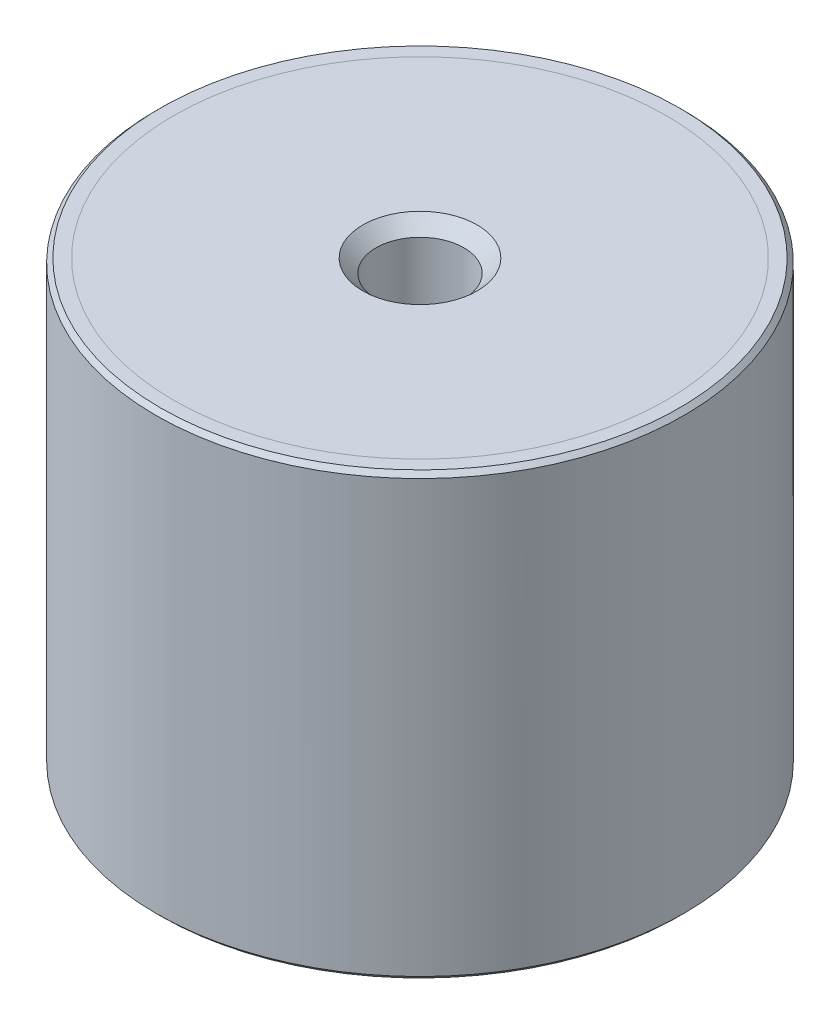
ISO-10303-21;
HEADER;
FILE_DESCRIPTION(('STEP AP214'),'2;1');
FILE_NAME('part.step','',(''),(''),'','','');
FILE_SCHEMA(('AUTOMOTIVE_DESIGN { 1 0 10303 214 1 1 1 1 }'));
ENDSEC;
DATA;
#1=APPLICATION_CONTEXT('core data for automotive mechanical design processes');
#2=APPLICATION_PROTOCOL_DEFINITION('international standard','automotive_design',2000,#1);
#3=PRODUCT_CONTEXT('',#1,'mechanical');
#4=PRODUCT('Part','Part','',(#3));
#5=PRODUCT_RELATED_PRODUCT_CATEGORY('part','',(#4));
#6=PRODUCT_DEFINITION_FORMATION('','',#4);
#7=PRODUCT_DEFINITION_CONTEXT('part definition',#1,'design');
#8=PRODUCT_DEFINITION('design','',#6,#7);
#9=PRODUCT_DEFINITION_SHAPE('','',#8);
#10=(LENGTH_UNIT() NAMED_UNIT(*) SI_UNIT(.MILLI.,.METRE.));
#11=(NAMED_UNIT(*) PLANE_ANGLE_UNIT() SI_UNIT($,.RADIAN.));
#12=(NAMED_UNIT(*) SI_UNIT($,.STERADIAN.) SOLID_ANGLE_UNIT());
#13=UNCERTAINTY_MEASURE_WITH_UNIT(LENGTH_MEASURE(1.E-05),#10,'distance_accuracy_value','');
#14=(GEOMETRIC_REPRESENTATION_CONTEXT(3) GLOBAL_UNCERTAINTY_ASSIGNED_CONTEXT((#13)) GLOBAL_UNIT_ASSIGNED_CONTEXT((#10,
#11,#12)) REPRESENTATION_CONTEXT('',''));
#15=CARTESIAN_POINT('',(0.,0.,0.));
#16=DIRECTION('',(0.,0.,1.));
#17=DIRECTION('',(1.,0.,0.));
#18=AXIS2_PLACEMENT_3D('',#15,#16,#17);
#19=CARTESIAN_POINT('',(0.,-47.,5.));
#20=DIRECTION('',(0.,1.,0.));
#21=DIRECTION('',(0.,0.,1.));
#22=AXIS2_PLACEMENT_3D('',#19,#20,#21);
#23=PLANE('',#22);
#24=CARTESIAN_POINT('',(0.,-47.,0.));
#25=DIRECTION('',(0.,1.,0.));
#26=DIRECTION('',(0.,0.,1.));
#27=AXIS2_PLACEMENT_3D('',#24,#25,#26);
#28=CIRCLE('',#27,28.);
#29=CARTESIAN_POINT('',(0.,-47.,28.));
#30=VERTEX_POINT('',#29);
#31=EDGE_CURVE('P0_E25',#30,#30,#28,.T.);
#32=ORIENTED_EDGE('',*,*,#31,.T.);
#33=EDGE_LOOP('',(#32));
#34=FACE_BOUND('',#33,.T.);
#35=CARTESIAN_POINT('',(0.,-47.,0.));
#36=DIRECTION('',(0.,1.,0.));
#37=DIRECTION('',(0.,0.,1.));
#38=AXIS2_PLACEMENT_3D('',#35,#36,#37);
#39=CIRCLE('',#38,5.);
#40=CARTESIAN_POINT('',(0.,-47.,5.));
#41=VERTEX_POINT('',#40);
#42=EDGE_CURVE('P0_E21',#41,#41,#39,.T.);
#43=ORIENTED_EDGE('',*,*,#42,.F.);
#44=EDGE_LOOP('',(#43));
#45=FACE_BOUND('',#44,.T.);
#46=ADVANCED_FACE('P0_F14',(#34,#45),#23,.T.);
#47=CARTESIAN_POINT('',(0.,21.0340428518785,0.));
#48=DIRECTION('',(0.,1.,0.));
#49=DIRECTION('',(0.,0.,1.));
#50=AXIS2_PLACEMENT_3D('',#47,#48,#49);
#51=CYLINDRICAL_SURFACE('',#50,28.);
#52=CARTESIAN_POINT('',(0.,-48.5,0.));
#53=DIRECTION('',(0.,1.,0.));
#54=DIRECTION('',(0.,0.,1.));
#55=AXIS2_PLACEMENT_3D('',#52,#53,#54);
#56=CIRCLE('',#55,28.);
#57=CARTESIAN_POINT('',(0.,-48.5,28.));
#58=VERTEX_POINT('',#57);
#59=EDGE_CURVE('P0_E29',#58,#58,#56,.T.);
#60=ORIENTED_EDGE('',*,*,#59,.T.);
#61=EDGE_LOOP('',(#60));
#62=FACE_BOUND('',#61,.T.);
#63=ORIENTED_EDGE('',*,*,#31,.F.);
#64=EDGE_LOOP('',(#63));
#65=FACE_BOUND('',#64,.T.);
#66=ADVANCED_FACE('P0_F35',(#62,#65),#51,.T.);
#67=CARTESIAN_POINT('',(0.,-48.5,28.));
#68=DIRECTION('',(0.,-1.,0.));
#69=DIRECTION('',(0.,0.,-1.));
#70=AXIS2_PLACEMENT_3D('',#67,#68,#69);
#71=PLANE('',#70);
#72=CARTESIAN_POINT('',(0.,-48.5,0.));
#73=DIRECTION('',(0.,-1.,0.));
#74=DIRECTION('',(0.,0.,-1.));
#75=AXIS2_PLACEMENT_3D('',#72,#73,#74);
#76=CIRCLE('',#75,6.49999999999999);
#77=CARTESIAN_POINT('',(0.,-48.5,-6.49999999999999));
#78=VERTEX_POINT('',#77);
#79=EDGE_CURVE('P0_E10',#78,#78,#76,.F.);
#80=ORIENTED_EDGE('',*,*,#79,.T.);
#81=EDGE_LOOP('',(#80));
#82=FACE_BOUND('',#81,.T.);
#83=ORIENTED_EDGE('',*,*,#59,.F.);
#84=EDGE_LOOP('',(#83));
#85=FACE_BOUND('',#84,.T.);
#86=ADVANCED_FACE('P0_F38',(#82,#85),#71,.T.);
#87=CARTESIAN_POINT('',(0.,-48.5,0.));
#88=DIRECTION('',(0.,-1.,0.));
#89=DIRECTION('',(0.,0.,-1.));
#90=AXIS2_PLACEMENT_3D('',#87,#88,#89);
#91=CONICAL_SURFACE('',#90,6.49999999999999,0.785398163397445);
#92=ORIENTED_EDGE('',*,*,#42,.T.);
#93=EDGE_LOOP('',(#92));
#94=FACE_BOUND('',#93,.T.);
#95=ORIENTED_EDGE('',*,*,#79,.F.);
#96=EDGE_LOOP('',(#95));
#97=FACE_BOUND('',#96,.T.);
#98=ADVANCED_FACE('P0_F16',(#94,#97),#91,.F.);
#99=CLOSED_SHELL('',(#46,#66,#86,#98));
#100=MANIFOLD_SOLID_BREP('P0_B1',#99);
#101=CARTESIAN_POINT('',(0.,1.5,5.));
#102=DIRECTION('',(0.,1.,0.));
#103=DIRECTION('',(0.,0.,1.));
#104=AXIS2_PLACEMENT_3D('',#101,#102,#103);
#105=PLANE('',#104);
#106=CARTESIAN_POINT('',(0.,1.5,0.));
#107=DIRECTION('',(0.,1.,0.));
#108=DIRECTION('',(0.,0.,1.));
#109=AXIS2_PLACEMENT_3D('',#106,#107,#108);
#110=CIRCLE('',#109,6.49999999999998);
#111=CARTESIAN_POINT('',(0.,1.5,6.49999999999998));
#112=VERTEX_POINT('',#111);
#113=EDGE_CURVE('P1_E10',#112,#112,#110,.F.);
#114=ORIENTED_EDGE('',*,*,#113,.T.);
#115=EDGE_LOOP('',(#114));
#116=FACE_BOUND('',#115,.T.);
#117=CARTESIAN_POINT('',(0.,1.5,0.));
#118=DIRECTION('',(0.,1.,0.));
#119=DIRECTION('',(0.,0.,1.));
#120=AXIS2_PLACEMENT_3D('',#117,#118,#119);
#121=CIRCLE('',#120,28.);
#122=CARTESIAN_POINT('',(0.,1.5,28.));
#123=VERTEX_POINT('',#122);
#124=EDGE_CURVE('P1_E21',#123,#123,#121,.T.);
#125=ORIENTED_EDGE('',*,*,#124,.T.);
#126=EDGE_LOOP('',(#125));
#127=FACE_BOUND('',#126,.T.);
#128=ADVANCED_FACE('P1_F14',(#116,#127),#105,.T.);
#129=CARTESIAN_POINT('',(0.,69.5340428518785,0.));
#130=DIRECTION('',(0.,1.,0.));
#131=DIRECTION('',(0.,0.,1.));
#132=AXIS2_PLACEMENT_3D('',#129,#130,#131);
#133=CYLINDRICAL_SURFACE('',#132,28.);
#134=CARTESIAN_POINT('',(0.,0.,0.));
#135=DIRECTION('',(0.,1.,0.));
#136=DIRECTION('',(0.,0.,1.));
#137=AXIS2_PLACEMENT_3D('',#134,#135,#136);
#138=CIRCLE('',#137,28.);
#139=CARTESIAN_POINT('',(0.,0.,28.));
#140=VERTEX_POINT('',#139);
#141=EDGE_CURVE('P1_E25',#140,#140,#138,.T.);
#142=ORIENTED_EDGE('',*,*,#141,.T.);
#143=EDGE_LOOP('',(#142));
#144=FACE_BOUND('',#143,.T.);
#145=ORIENTED_EDGE('',*,*,#124,.F.);
#146=EDGE_LOOP('',(#145));
#147=FACE_BOUND('',#146,.T.);
#148=ADVANCED_FACE('P1_F44',(#144,#147),#133,.T.);
#149=CARTESIAN_POINT('',(0.,0.,28.));
#150=DIRECTION('',(0.,-1.,0.));
#151=DIRECTION('',(0.,0.,-1.));
#152=AXIS2_PLACEMENT_3D('',#149,#150,#151);
#153=PLANE('',#152);
#154=CARTESIAN_POINT('',(0.,0.,0.));
#155=DIRECTION('',(0.,1.,0.));
#156=DIRECTION('',(0.,0.,1.));
#157=AXIS2_PLACEMENT_3D('',#154,#155,#156);
#158=CIRCLE('',#157,5.);
#159=CARTESIAN_POINT('',(0.,0.,4.99999999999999));
#160=VERTEX_POINT('',#159);
#161=EDGE_CURVE('P1_E29',#160,#160,#158,.T.);
#162=ORIENTED_EDGE('',*,*,#161,.T.);
#163=EDGE_LOOP('',(#162));
#164=FACE_BOUND('',#163,.T.);
#165=ORIENTED_EDGE('',*,*,#141,.F.);
#166=EDGE_LOOP('',(#165));
#167=FACE_BOUND('',#166,.T.);
#168=ADVANCED_FACE('P1_F35',(#164,#167),#153,.T.);
#169=CARTESIAN_POINT('',(0.,0.,0.));
#170=DIRECTION('',(0.,1.,0.));
#171=DIRECTION('',(0.,0.,1.));
#172=AXIS2_PLACEMENT_3D('',#169,#170,#171);
#173=CONICAL_SURFACE('',#172,5.,0.785398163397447);
#174=CARTESIAN_POINT('',(0.,1.5,6.49999999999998));
#175=CARTESIAN_POINT('',(0.,1.484375,6.48437499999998));
#176=CARTESIAN_POINT('',(0.,1.46875,6.46874999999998));
#177=CARTESIAN_POINT('',(0.,1.4375,6.43749999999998));
#178=CARTESIAN_POINT('',(0.,1.421875,6.42187499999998));
#179=CARTESIAN_POINT('',(0.,1.390625,6.39062499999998));
#180=CARTESIAN_POINT('',(0.,1.375,6.37499999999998));
#181=CARTESIAN_POINT('',(0.,1.34375,6.34374999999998));
#182=CARTESIAN_POINT('',(0.,1.328125,6.32812499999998));
#183=CARTESIAN_POINT('',(0.,1.296875,6.29687499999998));
#184=CARTESIAN_POINT('',(0.,1.28125,6.28124999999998));
#185=CARTESIAN_POINT('',(0.,1.25,6.24999999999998));
#186=CARTESIAN_POINT('',(0.,1.234375,6.23437499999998));
#187=CARTESIAN_POINT('',(0.,1.203125,6.20312499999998));
#188=CARTESIAN_POINT('',(0.,1.1875,6.18749999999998));
#189=CARTESIAN_POINT('',(0.,1.15625,6.15624999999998));
#190=CARTESIAN_POINT('',(0.,1.140625,6.14062499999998));
#191=CARTESIAN_POINT('',(0.,1.109375,6.10937499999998));
#192=CARTESIAN_POINT('',(0.,1.09375,6.09374999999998));
#193=CARTESIAN_POINT('',(0.,1.0625,6.06249999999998));
#194=CARTESIAN_POINT('',(0.,1.046875,6.04687499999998));
#195=CARTESIAN_POINT('',(0.,1.015625,6.01562499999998));
#196=CARTESIAN_POINT('',(0.,0.999999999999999,5.99999999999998));
#197=CARTESIAN_POINT('',(0.,0.968749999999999,5.96874999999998));
#198=CARTESIAN_POINT('',(0.,0.953124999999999,5.95312499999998));
#199=CARTESIAN_POINT('',(0.,0.921874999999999,5.92187499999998));
#200=CARTESIAN_POINT('',(0.,0.906249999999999,5.90624999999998));
#201=CARTESIAN_POINT('',(0.,0.874999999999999,5.87499999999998));
#202=CARTESIAN_POINT('',(0.,0.859374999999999,5.85937499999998));
#203=CARTESIAN_POINT('',(0.,0.828124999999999,5.82812499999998));
#204=CARTESIAN_POINT('',(0.,0.812499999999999,5.81249999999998));
#205=CARTESIAN_POINT('',(0.,0.781249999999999,5.78124999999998));
#206=CARTESIAN_POINT('',(0.,0.765624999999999,5.76562499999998));
#207=CARTESIAN_POINT('',(0.,0.734374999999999,5.73437499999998));
#208=CARTESIAN_POINT('',(0.,0.718749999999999,5.71874999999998));
#209=CARTESIAN_POINT('',(0.,0.687499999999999,5.68749999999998));
#210=CARTESIAN_POINT('',(0.,0.671874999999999,5.67187499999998));
#211=CARTESIAN_POINT('',(0.,0.640624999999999,5.64062499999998));
#212=CARTESIAN_POINT('',(0.,0.624999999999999,5.62499999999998));
#213=CARTESIAN_POINT('',(0.,0.593749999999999,5.59374999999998));
#214=CARTESIAN_POINT('',(0.,0.578124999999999,5.57812499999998));
#215=CARTESIAN_POINT('',(0.,0.546874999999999,5.54687499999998));
#216=CARTESIAN_POINT('',(0.,0.531249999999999,5.53124999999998));
#217=CARTESIAN_POINT('',(0.,0.499999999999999,5.49999999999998));
#218=CARTESIAN_POINT('',(0.,0.484374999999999,5.48437499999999));
#219=CARTESIAN_POINT('',(0.,0.453124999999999,5.45312499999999));
#220=CARTESIAN_POINT('',(0.,0.437499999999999,5.43749999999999));
#221=CARTESIAN_POINT('',(0.,0.406249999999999,5.40624999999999));
#222=CARTESIAN_POINT('',(0.,0.390624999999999,5.39062499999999));
#223=CARTESIAN_POINT('',(0.,0.359374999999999,5.35937499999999));
#224=CARTESIAN_POINT('',(0.,0.343749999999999,5.34374999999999));
#225=CARTESIAN_POINT('',(0.,0.312499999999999,5.31249999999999));
#226=CARTESIAN_POINT('',(0.,0.296874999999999,5.29687499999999));
#227=CARTESIAN_POINT('',(0.,0.265624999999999,5.26562499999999));
#228=CARTESIAN_POINT('',(0.,0.249999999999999,5.24999999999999));
#229=CARTESIAN_POINT('',(0.,0.218749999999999,5.21874999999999));
#230=CARTESIAN_POINT('',(0.,0.203124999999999,5.20312499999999));
#231=CARTESIAN_POINT('',(0.,0.171874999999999,5.17187499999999));
#232=CARTESIAN_POINT('',(0.,0.156249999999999,5.15624999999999));
#233=CARTESIAN_POINT('',(0.,0.124999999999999,5.12499999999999));
#234=CARTESIAN_POINT('',(0.,0.109374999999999,5.10937499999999));
#235=CARTESIAN_POINT('',(0.,0.0781249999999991,5.07812499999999));
#236=CARTESIAN_POINT('',(0.,0.0624999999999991,5.06249999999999));
#237=CARTESIAN_POINT('',(0.,0.0312499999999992,5.03124999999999));
#238=CARTESIAN_POINT('',(0.,0.0156249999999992,5.01562499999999));
#239=CARTESIAN_POINT('',(0.,0.,4.99999999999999));
#240=B_SPLINE_CURVE_WITH_KNOTS('',3,(#174,#175,#176,#177,#178,#179,#180,#181,#182,#183,#184,
#185,#186,#187,#188,#189,#190,#191,#192,#193,#194,#195,#196,#197,#198,#199,#200,#201,#202,#203,
#204,#205,#206,#207,#208,#209,#210,#211,#212,#213,#214,#215,#216,#217,#218,#219,#220,#221,#222,
#223,#224,#225,#226,#227,#228,#229,#230,#231,#232,#233,#234,#235,#236,#237,#238,#239),
.UNSPECIFIED.,.F.,.F.,(4,2,2,2,2,2,2,2,2,2,2,2,2,2,2,2,2,2,2,2,2,2,2,2,2,2,2,2,2,2,2,2,4),(0.,
0.0662912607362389,0.132582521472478,0.198873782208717,0.265165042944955,0.331456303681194,
0.397747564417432,0.464038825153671,0.53033008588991,0.596621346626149,0.662912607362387,
0.729203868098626,0.795495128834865,0.861786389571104,0.928077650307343,0.994368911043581,
1.06066017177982,1.12695143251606,1.1932426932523,1.25953395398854,1.32582521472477,
1.39211647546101,1.45840773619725,1.52469899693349,1.59099025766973,1.65728151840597,
1.72357277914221,1.78986403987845,1.85615530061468,1.92244656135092,1.98873782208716,
2.0550290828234,2.12132034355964),.UNSPECIFIED.);
#241=EDGE_CURVE('P1_BSEAM16',#112,#160,#240,.T.);
#242=ORIENTED_EDGE('',*,*,#113,.F.);
#243=ORIENTED_EDGE('',*,*,#161,.F.);
#244=ORIENTED_EDGE('',*,*,#241,.T.);
#245=ORIENTED_EDGE('',*,*,#241,.F.);
#246=EDGE_LOOP('',(#242,#244,#243,#245));
#247=FACE_BOUND('',#246,.T.);
#248=ADVANCED_FACE('P1_F16',(#247),#173,.F.);
#249=CLOSED_SHELL('',(#128,#148,#168,#248));
#250=MANIFOLD_SOLID_BREP('P1_B1',#249);
#251=CARTESIAN_POINT('',(0.,0.,0.));
#252=DIRECTION('',(0.,1.,0.));
#253=DIRECTION('',(0.,0.,1.));
#254=AXIS2_PLACEMENT_3D('',#251,#252,#253);
#255=PLANE('',#254);
#256=CARTESIAN_POINT('',(0.,0.,0.));
#257=DIRECTION('',(0.,1.,0.));
#258=DIRECTION('',(0.,0.,1.));
#259=AXIS2_PLACEMENT_3D('',#256,#257,#258);
#260=CIRCLE('',#259,5.);
#261=CARTESIAN_POINT('',(0.,0.,5.));
#262=VERTEX_POINT('',#261);
#263=EDGE_CURVE('P2_E46',#262,#262,#260,.T.);
#264=ORIENTED_EDGE('',*,*,#263,.F.);
#265=EDGE_LOOP('',(#264));
#266=FACE_BOUND('',#265,.T.);
#267=CARTESIAN_POINT('',(0.,0.,0.));
#268=DIRECTION('',(0.,1.,0.));
#269=DIRECTION('',(0.,0.,1.));
#270=AXIS2_PLACEMENT_3D('',#267,#268,#269);
#271=CIRCLE('',#270,28.);
#272=CARTESIAN_POINT('',(0.,0.,28.));
#273=VERTEX_POINT('',#272);
#274=EDGE_CURVE('P2_E33',#273,#273,#271,.T.);
#275=ORIENTED_EDGE('',*,*,#274,.T.);
#276=EDGE_LOOP('',(#275));
#277=FACE_BOUND('',#276,.T.);
#278=ADVANCED_FACE('P2_F13',(#266,#277),#255,.T.);
#279=CARTESIAN_POINT('',(0.,65.5134936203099,0.));
#280=DIRECTION('',(0.,1.,0.));
#281=DIRECTION('',(0.,0.,1.));
#282=AXIS2_PLACEMENT_3D('',#279,#280,#281);
#283=CYLINDRICAL_SURFACE('',#282,28.);
#284=CARTESIAN_POINT('',(0.,1.5,0.));
#285=DIRECTION('',(0.,1.,0.));
#286=DIRECTION('',(0.,0.,1.));
#287=AXIS2_PLACEMENT_3D('',#284,#285,#286);
#288=CIRCLE('',#287,28.);
#289=CARTESIAN_POINT('',(0.,1.5,28.));
#290=VERTEX_POINT('',#289);
#291=EDGE_CURVE('P2_E36',#290,#290,#288,.T.);
#292=ORIENTED_EDGE('',*,*,#291,.T.);
#293=EDGE_LOOP('',(#292));
#294=FACE_BOUND('',#293,.T.);
#295=ORIENTED_EDGE('',*,*,#274,.F.);
#296=EDGE_LOOP('',(#295));
#297=FACE_BOUND('',#296,.T.);
#298=ADVANCED_FACE('P2_F92',(#294,#297),#283,.F.);
#299=CARTESIAN_POINT('',(0.,1.5,28.));
#300=DIRECTION('',(0.,1.,0.));
#301=DIRECTION('',(0.,0.,1.));
#302=AXIS2_PLACEMENT_3D('',#299,#300,#301);
#303=PLANE('',#302);
#304=CARTESIAN_POINT('',(0.,1.5,0.));
#305=DIRECTION('',(0.,1.,0.));
#306=DIRECTION('',(0.,0.,1.));
#307=AXIS2_PLACEMENT_3D('',#304,#305,#306);
#308=CIRCLE('',#307,29.5);
#309=CARTESIAN_POINT('',(0.,1.5,29.5));
#310=VERTEX_POINT('',#309);
#311=EDGE_CURVE('P2_E9',#310,#310,#308,.T.);
#312=ORIENTED_EDGE('',*,*,#311,.T.);
#313=EDGE_LOOP('',(#312));
#314=FACE_BOUND('',#313,.T.);
#315=ORIENTED_EDGE('',*,*,#291,.F.);
#316=EDGE_LOOP('',(#315));
#317=FACE_BOUND('',#316,.T.);
#318=ADVANCED_FACE('P2_F88',(#314,#317),#303,.T.);
#319=CARTESIAN_POINT('',(0.,65.5134936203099,0.));
#320=DIRECTION('',(0.,1.,0.));
#321=DIRECTION('',(0.,0.,1.));
#322=AXIS2_PLACEMENT_3D('',#319,#320,#321);
#323=CYLINDRICAL_SURFACE('',#322,30.);
#324=CARTESIAN_POINT('',(0.,-48.,0.));
#325=DIRECTION('',(0.,-1.,0.));
#326=DIRECTION('',(0.,0.,-1.));
#327=AXIS2_PLACEMENT_3D('',#324,#325,#326);
#328=CIRCLE('',#327,30.);
#329=CARTESIAN_POINT('',(0.,-48.,-30.));
#330=VERTEX_POINT('',#329);
#331=EDGE_CURVE('P2_E24',#330,#330,#328,.F.);
#332=ORIENTED_EDGE('',*,*,#331,.T.);
#333=EDGE_LOOP('',(#332));
#334=FACE_BOUND('',#333,.T.);
#335=CARTESIAN_POINT('',(0.,0.999999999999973,0.));
#336=DIRECTION('',(0.,1.,0.));
#337=DIRECTION('',(0.,0.,1.));
#338=AXIS2_PLACEMENT_3D('',#335,#336,#337);
#339=CIRCLE('',#338,30.);
#340=CARTESIAN_POINT('',(0.,0.999999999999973,30.));
#341=VERTEX_POINT('',#340);
#342=EDGE_CURVE('P2_E28',#341,#341,#339,.F.);
#343=ORIENTED_EDGE('',*,*,#342,.T.);
#344=EDGE_LOOP('',(#343));
#345=FACE_BOUND('',#344,.T.);
#346=ADVANCED_FACE('P2_F82',(#334,#345),#323,.T.);
#347=CARTESIAN_POINT('',(0.,-48.5,30.));
#348=DIRECTION('',(0.,-1.,0.));
#349=DIRECTION('',(0.,0.,-1.));
#350=AXIS2_PLACEMENT_3D('',#347,#348,#349);
#351=PLANE('',#350);
#352=CARTESIAN_POINT('',(0.,-48.5,0.));
#353=DIRECTION('',(0.,-1.,0.));
#354=DIRECTION('',(0.,0.,-1.));
#355=AXIS2_PLACEMENT_3D('',#352,#353,#354);
#356=CIRCLE('',#355,29.5);
#357=CARTESIAN_POINT('',(0.,-48.5,-29.5));
#358=VERTEX_POINT('',#357);
#359=EDGE_CURVE('P2_E20',#358,#358,#356,.T.);
#360=ORIENTED_EDGE('',*,*,#359,.T.);
#361=EDGE_LOOP('',(#360));
#362=FACE_BOUND('',#361,.T.);
#363=CARTESIAN_POINT('',(0.,-48.5,0.));
#364=DIRECTION('',(0.,1.,0.));
#365=DIRECTION('',(0.,0.,1.));
#366=AXIS2_PLACEMENT_3D('',#363,#364,#365);
#367=CIRCLE('',#366,28.);
#368=CARTESIAN_POINT('',(0.,-48.5,28.));
#369=VERTEX_POINT('',#368);
#370=EDGE_CURVE('P2_E39',#369,#369,#367,.T.);
#371=ORIENTED_EDGE('',*,*,#370,.T.);
#372=EDGE_LOOP('',(#371));
#373=FACE_BOUND('',#372,.T.);
#374=ADVANCED_FACE('P2_F77',(#362,#373),#351,.T.);
#375=CARTESIAN_POINT('',(0.,65.5134936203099,0.));
#376=DIRECTION('',(0.,1.,0.));
#377=DIRECTION('',(0.,0.,1.));
#378=AXIS2_PLACEMENT_3D('',#375,#376,#377);
#379=CYLINDRICAL_SURFACE('',#378,28.);
#380=CARTESIAN_POINT('',(0.,-47.,0.));
#381=DIRECTION('',(0.,1.,0.));
#382=DIRECTION('',(0.,0.,1.));
#383=AXIS2_PLACEMENT_3D('',#380,#381,#382);
#384=CIRCLE('',#383,28.);
#385=CARTESIAN_POINT('',(0.,-47.,28.));
#386=VERTEX_POINT('',#385);
#387=EDGE_CURVE('P2_E42',#386,#386,#384,.T.);
#388=ORIENTED_EDGE('',*,*,#387,.T.);
#389=EDGE_LOOP('',(#388));
#390=FACE_BOUND('',#389,.T.);
#391=ORIENTED_EDGE('',*,*,#370,.F.);
#392=EDGE_LOOP('',(#391));
#393=FACE_BOUND('',#392,.T.);
#394=ADVANCED_FACE('P2_F71',(#390,#393),#379,.F.);
#395=CARTESIAN_POINT('',(0.,-47.,28.));
#396=DIRECTION('',(0.,-1.,0.));
#397=DIRECTION('',(0.,0.,-1.));
#398=AXIS2_PLACEMENT_3D('',#395,#396,#397);
#399=PLANE('',#398);
#400=CARTESIAN_POINT('',(0.,-47.,0.));
#401=DIRECTION('',(0.,-1.,0.));
#402=DIRECTION('',(0.,0.,-1.));
#403=AXIS2_PLACEMENT_3D('',#400,#401,#402);
#404=CIRCLE('',#403,5.);
#405=CARTESIAN_POINT('',(0.,-47.,-5.));
#406=VERTEX_POINT('',#405);
#407=EDGE_CURVE('P2_E52',#406,#406,#404,.T.);
#408=ORIENTED_EDGE('',*,*,#407,.F.);
#409=EDGE_LOOP('',(#408));
#410=FACE_BOUND('',#409,.T.);
#411=ORIENTED_EDGE('',*,*,#387,.F.);
#412=EDGE_LOOP('',(#411));
#413=FACE_BOUND('',#412,.T.);
#414=ADVANCED_FACE('P2_F67',(#410,#413),#399,.T.);
#415=CARTESIAN_POINT('',(0.,-48.,0.));
#416=DIRECTION('',(0.,1.,0.));
#417=DIRECTION('',(0.,0.,1.));
#418=AXIS2_PLACEMENT_3D('',#415,#416,#417);
#419=CONICAL_SURFACE('',#418,30.,0.785398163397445);
#420=ORIENTED_EDGE('',*,*,#359,.F.);
#421=EDGE_LOOP('',(#420));
#422=FACE_BOUND('',#421,.T.);
#423=ORIENTED_EDGE('',*,*,#331,.F.);
#424=EDGE_LOOP('',(#423));
#425=FACE_BOUND('',#424,.T.);
#426=ADVANCED_FACE('P2_F70',(#422,#425),#419,.T.);
#427=CARTESIAN_POINT('',(0.,1.5,0.));
#428=DIRECTION('',(0.,-1.,0.));
#429=DIRECTION('',(0.,0.,-1.));
#430=AXIS2_PLACEMENT_3D('',#427,#428,#429);
#431=CONICAL_SURFACE('',#430,29.5,0.785398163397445);
#432=ORIENTED_EDGE('',*,*,#342,.F.);
#433=EDGE_LOOP('',(#432));
#434=FACE_BOUND('',#433,.T.);
#435=ORIENTED_EDGE('',*,*,#311,.F.);
#436=EDGE_LOOP('',(#435));
#437=FACE_BOUND('',#436,.T.);
#438=ADVANCED_FACE('P2_F15',(#434,#437),#431,.T.);
#439=CARTESIAN_POINT('',(0.,-8.5,0.));
#440=DIRECTION('',(0.,1.,0.));
#441=DIRECTION('',(0.,0.,1.));
#442=AXIS2_PLACEMENT_3D('',#439,#440,#441);
#443=CYLINDRICAL_SURFACE('',#442,5.);
#444=CARTESIAN_POINT('',(0.,-8.5,0.));
#445=DIRECTION('',(0.,1.,0.));
#446=DIRECTION('',(0.,0.,1.));
#447=AXIS2_PLACEMENT_3D('',#444,#445,#446);
#448=CIRCLE('',#447,5.);
#449=CARTESIAN_POINT('',(0.,-8.5,5.));
#450=VERTEX_POINT('',#449);
#451=EDGE_CURVE('P2_E45',#450,#450,#448,.T.);
#452=ORIENTED_EDGE('',*,*,#451,.F.);
#453=EDGE_LOOP('',(#452));
#454=FACE_BOUND('',#453,.T.);
#455=ORIENTED_EDGE('',*,*,#263,.T.);
#456=EDGE_LOOP('',(#455));
#457=FACE_BOUND('',#456,.T.);
#458=ADVANCED_FACE('P2_F108',(#454,#457),#443,.F.);
#459=CARTESIAN_POINT('',(0.,-8.5,0.));
#460=DIRECTION('',(0.,1.,0.));
#461=DIRECTION('',(0.,0.,1.));
#462=AXIS2_PLACEMENT_3D('',#459,#460,#461);
#463=PLANE('',#462);
#464=ORIENTED_EDGE('',*,*,#451,.T.);
#465=EDGE_LOOP('',(#464));
#466=FACE_BOUND('',#465,.T.);
#467=ADVANCED_FACE('P2_F63',(#466),#463,.T.);
#468=CARTESIAN_POINT('',(0.,-38.5,0.));
#469=DIRECTION('',(0.,-1.,0.));
#470=DIRECTION('',(0.,0.,-1.));
#471=AXIS2_PLACEMENT_3D('',#468,#469,#470);
#472=CYLINDRICAL_SURFACE('',#471,5.);
#473=CARTESIAN_POINT('',(0.,-38.5,0.));
#474=DIRECTION('',(0.,-1.,0.));
#475=DIRECTION('',(0.,0.,-1.));
#476=AXIS2_PLACEMENT_3D('',#473,#474,#475);
#477=CIRCLE('',#476,5.);
#478=CARTESIAN_POINT('',(0.,-38.5,-5.));
#479=VERTEX_POINT('',#478);
#480=EDGE_CURVE('P2_E49',#479,#479,#477,.T.);
#481=ORIENTED_EDGE('',*,*,#480,.F.);
#482=EDGE_LOOP('',(#481));
#483=FACE_BOUND('',#482,.T.);
#484=ORIENTED_EDGE('',*,*,#407,.T.);
#485=EDGE_LOOP('',(#484));
#486=FACE_BOUND('',#485,.T.);
#487=ADVANCED_FACE('P2_F60',(#483,#486),#472,.F.);
#488=CARTESIAN_POINT('',(0.,-38.5,0.));
#489=DIRECTION('',(0.,-1.,0.));
#490=DIRECTION('',(0.,0.,-1.));
#491=AXIS2_PLACEMENT_3D('',#488,#489,#490);
#492=PLANE('',#491);
#493=ORIENTED_EDGE('',*,*,#480,.T.);
#494=EDGE_LOOP('',(#493));
#495=FACE_BOUND('',#494,.T.);
#496=ADVANCED_FACE('P2_F58',(#495),#492,.T.);
#497=CLOSED_SHELL('',(#278,#298,#318,#346,#374,#394,#414,#426,#438,#458,#467,#487,#496));
#498=MANIFOLD_SOLID_BREP('P2_B1',#497);
#499=ADVANCED_BREP_SHAPE_REPRESENTATION('',(#18,#100,#250,#498),#14);
#500=SHAPE_DEFINITION_REPRESENTATION(#9,#499);
ENDSEC;
END-ISO-10303-21;
